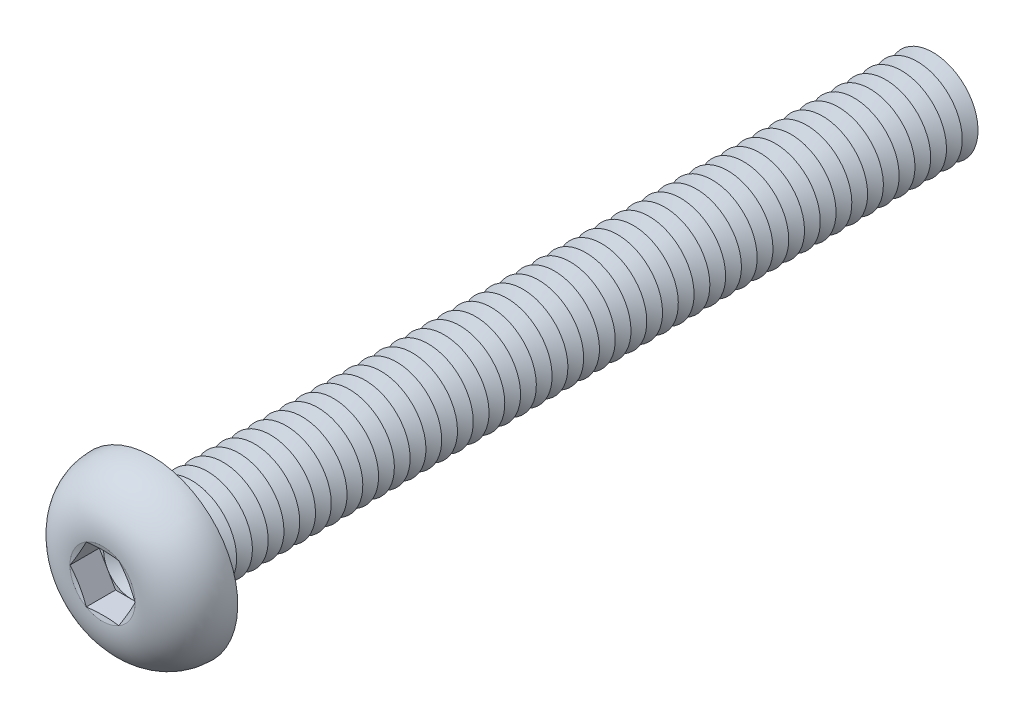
from build123d import *

# Parameters (mm, degrees)
FILLET1_R          = 0.35
LPATTERN1_COUNT    = 50
LPATTERN1_PITCH    = 0.7
CUT_EXTRUDE1_DEPTH = 1.3


with BuildPart() as part:
    # Sketch1 → Revolve1 (revolve)
    with BuildSketch(Plane(origin=(0, 0, 0), x_dir=(0, 0, -1), z_dir=(1, 0, 0))):
        with BuildLine():
            Line((0, 2), (0, 3.8))
            ThreePointArc((0, 3.8), (-1.611961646, 3.099623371), (-2.2, 1.443375))
            Line((-2.2, 1.443375), (-2.006624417, 0.7216875))
            Line((-2.006624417, 0.7216875), (-2.2, 0.7216875))
            Line((-2.2, 0.7216875), (-2.2, 0))
            Line((-2.2, 0), (35, 0))
            Line((35, 0), (35, 2))
            Line((35, 2), (0, 2))
        make_face()
    revolve(axis=Axis((0, 0, -35), (0, 0, 1)))

    # Fillet1
    fillet1_edges = [part.edges().sort_by_distance(p)[0] for p in [
        (0, -2, 0),
    ]]
    fillet(fillet1_edges, radius=FILLET1_R)

    # Sketch2 → Cut-Revolve1 (revolve, cut)
    with BuildSketch(Plane(origin=(0, 0, 0), x_dir=(0, 0, -1), z_dir=(1, 0, 0))):
        Polygon((34.65, 2), (35.35, 2), (35, 1.393782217), align=None)
    cut_revolve1 = revolve(axis=Axis((0, 0, -35), (0, 0, -1)), mode=Mode.SUBTRACT)

    # LPattern1: Cut-Revolve1 ×50
    with Locations(*[(0, 0, i * LPATTERN1_PITCH) for i in range(1, LPATTERN1_COUNT)]):
        add(cut_revolve1, mode=Mode.SUBTRACT)

    # Sketch3 → Cut-Extrude1 (cut)
    with BuildSketch(Plane.XY.offset(2.2)):
        Polygon((0.7216875, 1.249999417), (-0.7216875, 1.249999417), (-1.443375, 0), (-0.7216875, -1.249999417), (0.7216875, -1.249999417), (1.443375, 0), align=None)
    extrude(amount=-CUT_EXTRUDE1_DEPTH, mode=Mode.SUBTRACT)

    # Cut-Extrude2 cone 1 section (on through the dimple's axis) → Cut-Extrude2 (revolve, cut)
    with BuildSketch(Plane(origin=(0, 0, 0.9), x_dir=(0, -1, 0), z_dir=(1, 0, 0))):
        Polygon((0, 0), (1.249999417, 0), (0, 0.7216875), align=None)
    revolve(axis=Axis((0, 0, 0.9), (0, 0, -1)), mode=Mode.SUBTRACT)


solid = part.part
